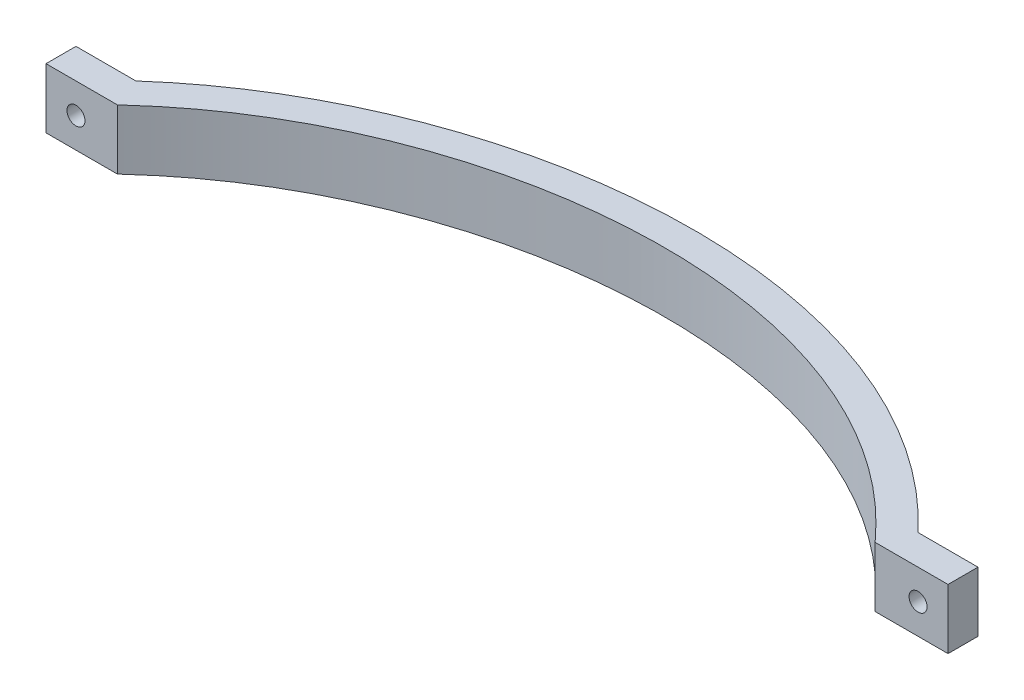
ISO-10303-21;
HEADER;
FILE_DESCRIPTION(('STEP AP214'),'2;1');
FILE_NAME('part.step','',(''),(''),'','','');
FILE_SCHEMA(('AUTOMOTIVE_DESIGN { 1 0 10303 214 1 1 1 1 }'));
ENDSEC;
DATA;
#1=APPLICATION_CONTEXT('core data for automotive mechanical design processes');
#2=APPLICATION_PROTOCOL_DEFINITION('international standard','automotive_design',2000,#1);
#3=PRODUCT_CONTEXT('',#1,'mechanical');
#4=PRODUCT('Part','Part','',(#3));
#5=PRODUCT_RELATED_PRODUCT_CATEGORY('part','',(#4));
#6=PRODUCT_DEFINITION_FORMATION('','',#4);
#7=PRODUCT_DEFINITION_CONTEXT('part definition',#1,'design');
#8=PRODUCT_DEFINITION('design','',#6,#7);
#9=PRODUCT_DEFINITION_SHAPE('','',#8);
#10=(LENGTH_UNIT() NAMED_UNIT(*) SI_UNIT(.MILLI.,.METRE.));
#11=(NAMED_UNIT(*) PLANE_ANGLE_UNIT() SI_UNIT($,.RADIAN.));
#12=(NAMED_UNIT(*) SI_UNIT($,.STERADIAN.) SOLID_ANGLE_UNIT());
#13=UNCERTAINTY_MEASURE_WITH_UNIT(LENGTH_MEASURE(1.E-05),#10,'distance_accuracy_value','');
#14=(GEOMETRIC_REPRESENTATION_CONTEXT(3) GLOBAL_UNCERTAINTY_ASSIGNED_CONTEXT((#13)) GLOBAL_UNIT_ASSIGNED_CONTEXT((#10,
#11,#12)) REPRESENTATION_CONTEXT('',''));
#15=CARTESIAN_POINT('',(0.,0.,0.));
#16=DIRECTION('',(0.,0.,1.));
#17=DIRECTION('',(1.,0.,0.));
#18=AXIS2_PLACEMENT_3D('',#15,#16,#17);
#19=CARTESIAN_POINT('',(-64.8466050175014,10.,0.));
#20=DIRECTION('',(1.,0.,0.));
#21=DIRECTION('',(0.,0.,-1.));
#22=AXIS2_PLACEMENT_3D('',#19,#20,#21);
#23=PLANE('',#22);
#24=DIRECTION('',(0.,0.,1.));
#25=VECTOR('',#24,1.);
#26=CARTESIAN_POINT('',(-64.8466050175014,0.,0.));
#27=LINE('',#26,#25);
#28=CARTESIAN_POINT('',(-64.8466050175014,0.,0.));
#29=VERTEX_POINT('',#28);
#30=CARTESIAN_POINT('',(-64.8466050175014,0.,5.));
#31=VERTEX_POINT('',#30);
#32=EDGE_CURVE('E194',#29,#31,#27,.T.);
#33=ORIENTED_EDGE('',*,*,#32,.T.);
#34=DIRECTION('',(0.,-1.,0.));
#35=VECTOR('',#34,1.);
#36=CARTESIAN_POINT('',(-64.8466050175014,10.,5.));
#37=LINE('',#36,#35);
#38=CARTESIAN_POINT('',(-64.8466050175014,10.,5.));
#39=VERTEX_POINT('',#38);
#40=EDGE_CURVE('E11',#39,#31,#37,.T.);
#41=ORIENTED_EDGE('',*,*,#40,.F.);
#42=DIRECTION('',(0.,0.,1.));
#43=VECTOR('',#42,1.);
#44=CARTESIAN_POINT('',(-64.8466050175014,10.,0.));
#45=LINE('',#44,#43);
#46=CARTESIAN_POINT('',(-64.8466050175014,10.,0.));
#47=VERTEX_POINT('',#46);
#48=EDGE_CURVE('E211',#47,#39,#45,.T.);
#49=ORIENTED_EDGE('',*,*,#48,.F.);
#50=DIRECTION('',(0.,-1.,0.));
#51=VECTOR('',#50,1.);
#52=CARTESIAN_POINT('',(-64.8466050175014,10.,0.));
#53=LINE('',#52,#51);
#54=EDGE_CURVE('E125',#47,#29,#53,.T.);
#55=ORIENTED_EDGE('',*,*,#54,.T.);
#56=EDGE_LOOP('',(#33,#41,#49,#55));
#57=FACE_BOUND('',#56,.T.);
#58=ADVANCED_FACE('F33',(#57),#23,.F.);
#59=CARTESIAN_POINT('',(-64.8466050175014,10.,5.));
#60=DIRECTION('',(0.,0.,-1.));
#61=DIRECTION('',(-1.,0.,0.));
#62=AXIS2_PLACEMENT_3D('',#59,#60,#61);
#63=PLANE('',#62);
#64=CARTESIAN_POINT('',(-59.8466050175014,5.,5.));
#65=DIRECTION('',(0.,0.,-1.));
#66=DIRECTION('',(-1.,0.,0.));
#67=AXIS2_PLACEMENT_3D('',#64,#65,#66);
#68=CIRCLE('',#67,1.5);
#69=CARTESIAN_POINT('',(-61.3466050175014,5.,5.));
#70=VERTEX_POINT('',#69);
#71=EDGE_CURVE('E215',#70,#70,#68,.T.);
#72=ORIENTED_EDGE('',*,*,#71,.T.);
#73=EDGE_LOOP('',(#72));
#74=FACE_BOUND('',#73,.T.);
#75=DIRECTION('',(1.,0.,0.));
#76=VECTOR('',#75,1.);
#77=CARTESIAN_POINT('',(-64.8466050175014,0.,5.));
#78=LINE('',#77,#76);
#79=CARTESIAN_POINT('',(-52.9436450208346,0.,4.99999999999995));
#80=VERTEX_POINT('',#79);
#81=EDGE_CURVE('E191',#31,#80,#78,.T.);
#82=ORIENTED_EDGE('',*,*,#81,.T.);
#83=DIRECTION('',(0.,-1.,0.));
#84=VECTOR('',#83,1.);
#85=CARTESIAN_POINT('',(-52.9436450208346,10.,4.99999999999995));
#86=LINE('',#85,#84);
#87=CARTESIAN_POINT('',(-52.9436450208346,10.,4.99999999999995));
#88=VERTEX_POINT('',#87);
#89=EDGE_CURVE('E41',#88,#80,#86,.T.);
#90=ORIENTED_EDGE('',*,*,#89,.F.);
#91=DIRECTION('',(1.,0.,0.));
#92=VECTOR('',#91,1.);
#93=CARTESIAN_POINT('',(-64.8466050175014,10.,5.));
#94=LINE('',#93,#92);
#95=EDGE_CURVE('E92',#39,#88,#94,.T.);
#96=ORIENTED_EDGE('',*,*,#95,.F.);
#97=ORIENTED_EDGE('',*,*,#40,.T.);
#98=EDGE_LOOP('',(#82,#90,#96,#97));
#99=FACE_BOUND('',#98,.T.);
#100=ADVANCED_FACE('F155',(#74,#99),#63,.F.);
#101=CARTESIAN_POINT('',(-52.9436450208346,10.,4.99999999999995));
#102=CARTESIAN_POINT('',(-52.3884023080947,10.,4.50576857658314));
#103=CARTESIAN_POINT('',(-51.5328860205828,10.,3.73834589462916));
#104=CARTESIAN_POINT('',(-50.4814983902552,10.,2.82088787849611));
#105=CARTESIAN_POINT('',(-48.855995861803,10.,1.44102152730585));
#106=CARTESIAN_POINT('',(-45.2428380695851,10.,-1.4336316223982));
#107=CARTESIAN_POINT('',(-39.3008242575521,10.,-5.47968188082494));
#108=CARTESIAN_POINT('',(-31.6644597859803,10.,-9.68616053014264));
#109=CARTESIAN_POINT('',(-20.9168461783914,10.,-14.3993066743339));
#110=CARTESIAN_POINT('',(-6.64828714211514,10.,-18.5418975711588));
#111=CARTESIAN_POINT('',(11.0808042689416,10.,-20.5241181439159));
#112=CARTESIAN_POINT('',(28.6834342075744,10.,-19.3561637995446));
#113=CARTESIAN_POINT('',(42.6484017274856,10.,-15.6496741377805));
#114=CARTESIAN_POINT('',(53.0626949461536,10.,-10.9887295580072));
#115=CARTESIAN_POINT('',(59.1920931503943,10.,-7.35629460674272));
#116=CARTESIAN_POINT('',(63.8316816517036,10.,-4.00868694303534));
#117=CARTESIAN_POINT('',(66.6135528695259,10.,-1.73041720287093));
#118=CARTESIAN_POINT('',(68.765525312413,10.,0.206923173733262));
#119=CARTESIAN_POINT('',(70.0756517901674,10.,1.46298607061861));
#120=CARTESIAN_POINT('',(71.1104066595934,10.,2.50250993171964));
#121=CARTESIAN_POINT('',(72.1083286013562,10.,3.54031351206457));
#122=CARTESIAN_POINT('',(72.9423109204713,10.,4.43105727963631));
#123=CARTESIAN_POINT('',(73.4791953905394,10.,5.));
#124=B_SPLINE_CURVE_WITH_KNOTS('',3,(#101,#102,#103,#104,#105,#106,#107,#108,#109,#110,#111,
#112,#113,#114,#115,#116,#117,#118,#119,#120,#121,#122,#123),.UNSPECIFIED.,.F.,.F.,(4,1,1,1,1,1,
1,1,1,1,1,1,1,1,1,1,1,1,1,1,4),(-0.0135883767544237,0.00247828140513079,0.010511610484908,
0.0185449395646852,0.0506782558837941,0.114944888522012,0.17921152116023,0.243478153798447,
0.372011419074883,0.500544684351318,0.629077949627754,0.75761121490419,0.821877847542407,
0.886144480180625,0.918277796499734,0.950411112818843,0.966477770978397,0.982544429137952,
0.990577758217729,0.998611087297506,1.01467774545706),.UNSPECIFIED.);
#125=DIRECTION('',(0.,-1.,0.));
#126=VECTOR('',#125,1.);
#127=SURFACE_OF_LINEAR_EXTRUSION('',#124,#126);
#128=CARTESIAN_POINT('',(-52.9436450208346,0.,4.99999999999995));
#129=CARTESIAN_POINT('',(-52.3884023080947,0.,4.50576857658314));
#130=CARTESIAN_POINT('',(-51.5328860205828,0.,3.73834589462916));
#131=CARTESIAN_POINT('',(-50.4814983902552,0.,2.82088787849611));
#132=CARTESIAN_POINT('',(-48.855995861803,0.,1.44102152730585));
#133=CARTESIAN_POINT('',(-45.2428380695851,0.,-1.4336316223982));
#134=CARTESIAN_POINT('',(-39.3008242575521,0.,-5.47968188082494));
#135=CARTESIAN_POINT('',(-31.6644597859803,0.,-9.68616053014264));
#136=CARTESIAN_POINT('',(-20.9168461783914,0.,-14.3993066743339));
#137=CARTESIAN_POINT('',(-6.64828714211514,0.,-18.5418975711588));
#138=CARTESIAN_POINT('',(11.0808042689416,0.,-20.5241181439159));
#139=CARTESIAN_POINT('',(28.6834342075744,0.,-19.3561637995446));
#140=CARTESIAN_POINT('',(42.6484017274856,0.,-15.6496741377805));
#141=CARTESIAN_POINT('',(53.0626949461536,0.,-10.9887295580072));
#142=CARTESIAN_POINT('',(59.1920931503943,0.,-7.35629460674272));
#143=CARTESIAN_POINT('',(63.8316816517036,0.,-4.00868694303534));
#144=CARTESIAN_POINT('',(66.6135528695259,0.,-1.73041720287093));
#145=CARTESIAN_POINT('',(68.765525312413,0.,0.206923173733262));
#146=CARTESIAN_POINT('',(70.0756517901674,0.,1.46298607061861));
#147=CARTESIAN_POINT('',(71.1104066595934,0.,2.50250993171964));
#148=CARTESIAN_POINT('',(72.1083286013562,0.,3.54031351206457));
#149=CARTESIAN_POINT('',(72.9423109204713,0.,4.43105727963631));
#150=CARTESIAN_POINT('',(73.4791953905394,0.,5.));
#151=B_SPLINE_CURVE_WITH_KNOTS('',3,(#128,#129,#130,#131,#132,#133,#134,#135,#136,#137,#138,
#139,#140,#141,#142,#143,#144,#145,#146,#147,#148,#149,#150),.UNSPECIFIED.,.F.,.F.,(4,1,1,1,1,1,
1,1,1,1,1,1,1,1,1,1,1,1,1,1,4),(-0.0135883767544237,0.00247828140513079,0.010511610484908,
0.0185449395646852,0.0506782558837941,0.114944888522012,0.17921152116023,0.243478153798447,
0.372011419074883,0.500544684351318,0.629077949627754,0.75761121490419,0.821877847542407,
0.886144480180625,0.918277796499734,0.950411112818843,0.966477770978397,0.982544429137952,
0.990577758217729,0.998611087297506,1.01467774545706),.UNSPECIFIED.);
#152=CARTESIAN_POINT('',(73.4791953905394,0.,5.));
#153=VERTEX_POINT('',#152);
#154=EDGE_CURVE('E187',#80,#153,#151,.T.);
#155=ORIENTED_EDGE('',*,*,#154,.T.);
#156=DIRECTION('',(0.,-1.,0.));
#157=VECTOR('',#156,1.);
#158=CARTESIAN_POINT('',(73.4791953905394,10.,5.));
#159=LINE('',#158,#157);
#160=CARTESIAN_POINT('',(73.4791953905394,10.,5.));
#161=VERTEX_POINT('',#160);
#162=EDGE_CURVE('E179',#161,#153,#159,.T.);
#163=ORIENTED_EDGE('',*,*,#162,.F.);
#164=EDGE_CURVE('E157',#88,#161,#124,.T.);
#165=ORIENTED_EDGE('',*,*,#164,.F.);
#166=ORIENTED_EDGE('',*,*,#89,.T.);
#167=EDGE_LOOP('',(#155,#163,#165,#166));
#168=FACE_BOUND('',#167,.T.);
#169=ADVANCED_FACE('F151',(#168),#127,.F.);
#170=CARTESIAN_POINT('',(73.4791953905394,10.,5.));
#171=DIRECTION('',(0.,0.,-1.));
#172=DIRECTION('',(-1.,0.,0.));
#173=AXIS2_PLACEMENT_3D('',#170,#171,#172);
#174=PLANE('',#173);
#175=CARTESIAN_POINT('',(80.6356686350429,5.,5.));
#176=DIRECTION('',(0.,0.,-1.));
#177=DIRECTION('',(-1.,0.,0.));
#178=AXIS2_PLACEMENT_3D('',#175,#176,#177);
#179=CIRCLE('',#178,1.5);
#180=CARTESIAN_POINT('',(79.1356686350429,5.,5.));
#181=VERTEX_POINT('',#180);
#182=EDGE_CURVE('E222',#181,#181,#179,.T.);
#183=ORIENTED_EDGE('',*,*,#182,.T.);
#184=EDGE_LOOP('',(#183));
#185=FACE_BOUND('',#184,.T.);
#186=DIRECTION('',(1.,0.,0.));
#187=VECTOR('',#186,1.);
#188=CARTESIAN_POINT('',(73.4791953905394,0.,5.));
#189=LINE('',#188,#187);
#190=CARTESIAN_POINT('',(85.6356686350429,0.,5.));
#191=VERTEX_POINT('',#190);
#192=EDGE_CURVE('E177',#153,#191,#189,.T.);
#193=ORIENTED_EDGE('',*,*,#192,.T.);
#194=DIRECTION('',(0.,-1.,0.));
#195=VECTOR('',#194,1.);
#196=CARTESIAN_POINT('',(85.6356686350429,10.,5.));
#197=LINE('',#196,#195);
#198=CARTESIAN_POINT('',(85.6356686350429,10.,5.));
#199=VERTEX_POINT('',#198);
#200=EDGE_CURVE('E175',#199,#191,#197,.T.);
#201=ORIENTED_EDGE('',*,*,#200,.F.);
#202=DIRECTION('',(1.,0.,0.));
#203=VECTOR('',#202,1.);
#204=CARTESIAN_POINT('',(73.4791953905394,10.,5.));
#205=LINE('',#204,#203);
#206=EDGE_CURVE('E163',#161,#199,#205,.T.);
#207=ORIENTED_EDGE('',*,*,#206,.F.);
#208=ORIENTED_EDGE('',*,*,#162,.T.);
#209=EDGE_LOOP('',(#193,#201,#207,#208));
#210=FACE_BOUND('',#209,.T.);
#211=ADVANCED_FACE('F147',(#185,#210),#174,.F.);
#212=CARTESIAN_POINT('',(85.6356686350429,10.,5.));
#213=DIRECTION('',(-1.,0.,0.));
#214=DIRECTION('',(0.,0.,1.));
#215=AXIS2_PLACEMENT_3D('',#212,#213,#214);
#216=PLANE('',#215);
#217=DIRECTION('',(0.,0.,-1.));
#218=VECTOR('',#217,1.);
#219=CARTESIAN_POINT('',(85.6356686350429,0.,5.));
#220=LINE('',#219,#218);
#221=CARTESIAN_POINT('',(85.6356686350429,0.,0.));
#222=VERTEX_POINT('',#221);
#223=EDGE_CURVE('E181',#191,#222,#220,.T.);
#224=ORIENTED_EDGE('',*,*,#223,.T.);
#225=DIRECTION('',(0.,-1.,0.));
#226=VECTOR('',#225,1.);
#227=CARTESIAN_POINT('',(85.6356686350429,10.,0.));
#228=LINE('',#227,#226);
#229=CARTESIAN_POINT('',(85.6356686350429,10.,0.));
#230=VERTEX_POINT('',#229);
#231=EDGE_CURVE('E120',#230,#222,#228,.T.);
#232=ORIENTED_EDGE('',*,*,#231,.F.);
#233=DIRECTION('',(0.,0.,-1.));
#234=VECTOR('',#233,1.);
#235=CARTESIAN_POINT('',(85.6356686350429,10.,5.));
#236=LINE('',#235,#234);
#237=EDGE_CURVE('E111',#199,#230,#236,.T.);
#238=ORIENTED_EDGE('',*,*,#237,.F.);
#239=ORIENTED_EDGE('',*,*,#200,.T.);
#240=EDGE_LOOP('',(#224,#232,#238,#239));
#241=FACE_BOUND('',#240,.T.);
#242=ADVANCED_FACE('F143',(#241),#216,.F.);
#243=CARTESIAN_POINT('',(75.6356686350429,10.,0.));
#244=DIRECTION('',(0.,0.,1.));
#245=DIRECTION('',(1.,0.,0.));
#246=AXIS2_PLACEMENT_3D('',#243,#244,#245);
#247=PLANE('',#246);
#248=CARTESIAN_POINT('',(80.6356686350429,5.,0.));
#249=DIRECTION('',(0.,0.,-1.));
#250=DIRECTION('',(-1.,0.,0.));
#251=AXIS2_PLACEMENT_3D('',#248,#249,#250);
#252=CIRCLE('',#251,1.5);
#253=CARTESIAN_POINT('',(79.1356686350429,5.,0.));
#254=VERTEX_POINT('',#253);
#255=EDGE_CURVE('E225',#254,#254,#252,.T.);
#256=ORIENTED_EDGE('',*,*,#255,.F.);
#257=EDGE_LOOP('',(#256));
#258=FACE_BOUND('',#257,.T.);
#259=DIRECTION('',(-1.,0.,0.));
#260=VECTOR('',#259,1.);
#261=CARTESIAN_POINT('',(75.6356686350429,0.,0.));
#262=LINE('',#261,#260);
#263=CARTESIAN_POINT('',(75.6356686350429,0.,0.));
#264=VERTEX_POINT('',#263);
#265=EDGE_CURVE('E119',#222,#264,#262,.T.);
#266=ORIENTED_EDGE('',*,*,#265,.T.);
#267=DIRECTION('',(0.,-1.,0.));
#268=VECTOR('',#267,1.);
#269=CARTESIAN_POINT('',(75.6356686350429,10.,0.));
#270=LINE('',#269,#268);
#271=CARTESIAN_POINT('',(75.6356686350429,10.,0.));
#272=VERTEX_POINT('',#271);
#273=EDGE_CURVE('E116',#272,#264,#270,.T.);
#274=ORIENTED_EDGE('',*,*,#273,.F.);
#275=DIRECTION('',(-1.,0.,0.));
#276=VECTOR('',#275,1.);
#277=CARTESIAN_POINT('',(75.6356686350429,10.,0.));
#278=LINE('',#277,#276);
#279=EDGE_CURVE('E105',#230,#272,#278,.T.);
#280=ORIENTED_EDGE('',*,*,#279,.F.);
#281=ORIENTED_EDGE('',*,*,#231,.T.);
#282=EDGE_LOOP('',(#266,#274,#280,#281));
#283=FACE_BOUND('',#282,.T.);
#284=ADVANCED_FACE('F117',(#258,#283),#247,.F.);
#285=CARTESIAN_POINT('',(75.6356686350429,10.,0.));
#286=CARTESIAN_POINT('',(42.0240350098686,10.,-35.618639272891));
#287=CARTESIAN_POINT('',(-19.978022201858,10.,-31.0371463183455));
#288=CARTESIAN_POINT('',(-54.8466050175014,10.,0.));
#289=B_SPLINE_CURVE_WITH_KNOTS('',3,(#285,#286,#287,#288),.UNSPECIFIED.,.F.,.F.,(4,4),(0.,1.),.UNSPECIFIED.);
#290=DIRECTION('',(0.,-1.,0.));
#291=VECTOR('',#290,1.);
#292=SURFACE_OF_LINEAR_EXTRUSION('',#289,#291);
#293=CARTESIAN_POINT('',(75.6356686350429,0.,0.));
#294=CARTESIAN_POINT('',(42.0240350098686,0.,-35.618639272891));
#295=CARTESIAN_POINT('',(-19.978022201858,0.,-31.0371463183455));
#296=CARTESIAN_POINT('',(-54.8466050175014,0.,0.));
#297=B_SPLINE_CURVE_WITH_KNOTS('',3,(#293,#294,#295,#296),.UNSPECIFIED.,.F.,.F.,(4,4),(0.,1.),.UNSPECIFIED.);
#298=CARTESIAN_POINT('',(-54.8466050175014,0.,0.));
#299=VERTEX_POINT('',#298);
#300=EDGE_CURVE('E78',#264,#299,#297,.T.);
#301=ORIENTED_EDGE('',*,*,#300,.T.);
#302=DIRECTION('',(0.,-1.,0.));
#303=VECTOR('',#302,1.);
#304=CARTESIAN_POINT('',(-54.8466050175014,10.,0.));
#305=LINE('',#304,#303);
#306=CARTESIAN_POINT('',(-54.8466050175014,10.,0.));
#307=VERTEX_POINT('',#306);
#308=EDGE_CURVE('E121',#307,#299,#305,.T.);
#309=ORIENTED_EDGE('',*,*,#308,.F.);
#310=EDGE_CURVE('E109',#272,#307,#289,.T.);
#311=ORIENTED_EDGE('',*,*,#310,.F.);
#312=ORIENTED_EDGE('',*,*,#273,.T.);
#313=EDGE_LOOP('',(#301,#309,#311,#312));
#314=FACE_BOUND('',#313,.T.);
#315=ADVANCED_FACE('F123',(#314),#292,.F.);
#316=CARTESIAN_POINT('',(-64.8466050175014,10.,0.));
#317=DIRECTION('',(0.,0.,1.));
#318=DIRECTION('',(1.,0.,0.));
#319=AXIS2_PLACEMENT_3D('',#316,#317,#318);
#320=PLANE('',#319);
#321=CARTESIAN_POINT('',(-59.8466050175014,5.,0.));
#322=DIRECTION('',(0.,0.,-1.));
#323=DIRECTION('',(-1.,0.,0.));
#324=AXIS2_PLACEMENT_3D('',#321,#322,#323);
#325=CIRCLE('',#324,1.5);
#326=CARTESIAN_POINT('',(-61.3466050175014,5.,0.));
#327=VERTEX_POINT('',#326);
#328=EDGE_CURVE('E217',#327,#327,#325,.T.);
#329=ORIENTED_EDGE('',*,*,#328,.F.);
#330=EDGE_LOOP('',(#329));
#331=FACE_BOUND('',#330,.T.);
#332=DIRECTION('',(-1.,0.,0.));
#333=VECTOR('',#332,1.);
#334=CARTESIAN_POINT('',(-64.8466050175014,0.,0.));
#335=LINE('',#334,#333);
#336=EDGE_CURVE('E84',#299,#29,#335,.T.);
#337=ORIENTED_EDGE('',*,*,#336,.T.);
#338=ORIENTED_EDGE('',*,*,#54,.F.);
#339=DIRECTION('',(-1.,0.,0.));
#340=VECTOR('',#339,1.);
#341=CARTESIAN_POINT('',(-64.8466050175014,10.,0.));
#342=LINE('',#341,#340);
#343=EDGE_CURVE('E49',#307,#47,#342,.T.);
#344=ORIENTED_EDGE('',*,*,#343,.F.);
#345=ORIENTED_EDGE('',*,*,#308,.T.);
#346=EDGE_LOOP('',(#337,#338,#344,#345));
#347=FACE_BOUND('',#346,.T.);
#348=ADVANCED_FACE('F139',(#331,#347),#320,.F.);
#349=CARTESIAN_POINT('',(11.0597273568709,10.,-19.9990889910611));
#350=DIRECTION('',(0.,-1.,0.));
#351=DIRECTION('',(0.,0.,-1.));
#352=AXIS2_PLACEMENT_3D('',#349,#350,#351);
#353=PLANE('',#352);
#354=ORIENTED_EDGE('',*,*,#48,.T.);
#355=ORIENTED_EDGE('',*,*,#95,.T.);
#356=ORIENTED_EDGE('',*,*,#164,.T.);
#357=ORIENTED_EDGE('',*,*,#206,.T.);
#358=ORIENTED_EDGE('',*,*,#237,.T.);
#359=ORIENTED_EDGE('',*,*,#279,.T.);
#360=ORIENTED_EDGE('',*,*,#310,.T.);
#361=ORIENTED_EDGE('',*,*,#343,.T.);
#362=EDGE_LOOP('',(#354,#355,#356,#357,#358,#359,#360,#361));
#363=FACE_BOUND('',#362,.T.);
#364=ADVANCED_FACE('F107',(#363),#353,.F.);
#365=CARTESIAN_POINT('',(11.0597273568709,0.,-19.9990889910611));
#366=DIRECTION('',(0.,-1.,0.));
#367=DIRECTION('',(0.,0.,-1.));
#368=AXIS2_PLACEMENT_3D('',#365,#366,#367);
#369=PLANE('',#368);
#370=ORIENTED_EDGE('',*,*,#32,.F.);
#371=ORIENTED_EDGE('',*,*,#336,.F.);
#372=ORIENTED_EDGE('',*,*,#300,.F.);
#373=ORIENTED_EDGE('',*,*,#265,.F.);
#374=ORIENTED_EDGE('',*,*,#223,.F.);
#375=ORIENTED_EDGE('',*,*,#192,.F.);
#376=ORIENTED_EDGE('',*,*,#154,.F.);
#377=ORIENTED_EDGE('',*,*,#81,.F.);
#378=EDGE_LOOP('',(#370,#371,#372,#373,#374,#375,#376,#377));
#379=FACE_BOUND('',#378,.T.);
#380=ADVANCED_FACE('F190',(#379),#369,.T.);
#381=CARTESIAN_POINT('',(-59.8466050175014,5.,5.));
#382=DIRECTION('',(0.,0.,-1.));
#383=DIRECTION('',(-1.,0.,0.));
#384=AXIS2_PLACEMENT_3D('',#381,#382,#383);
#385=CYLINDRICAL_SURFACE('',#384,1.5);
#386=ORIENTED_EDGE('',*,*,#71,.F.);
#387=EDGE_LOOP('',(#386));
#388=FACE_BOUND('',#387,.T.);
#389=ORIENTED_EDGE('',*,*,#328,.T.);
#390=EDGE_LOOP('',(#389));
#391=FACE_BOUND('',#390,.T.);
#392=ADVANCED_FACE('F273',(#388,#391),#385,.F.);
#393=CARTESIAN_POINT('',(80.6356686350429,5.,5.));
#394=DIRECTION('',(0.,0.,-1.));
#395=DIRECTION('',(-1.,0.,0.));
#396=AXIS2_PLACEMENT_3D('',#393,#394,#395);
#397=CYLINDRICAL_SURFACE('',#396,1.5);
#398=ORIENTED_EDGE('',*,*,#182,.F.);
#399=EDGE_LOOP('',(#398));
#400=FACE_BOUND('',#399,.T.);
#401=ORIENTED_EDGE('',*,*,#255,.T.);
#402=EDGE_LOOP('',(#401));
#403=FACE_BOUND('',#402,.T.);
#404=ADVANCED_FACE('F301',(#400,#403),#397,.F.);
#405=CLOSED_SHELL('',(#58,#100,#169,#211,#242,#284,#315,#348,#364,#380,#392,#404));
#406=MANIFOLD_SOLID_BREP('B2',#405);
#407=ADVANCED_BREP_SHAPE_REPRESENTATION('',(#18,#406),#14);
#408=SHAPE_DEFINITION_REPRESENTATION(#9,#407);
ENDSEC;
END-ISO-10303-21;
